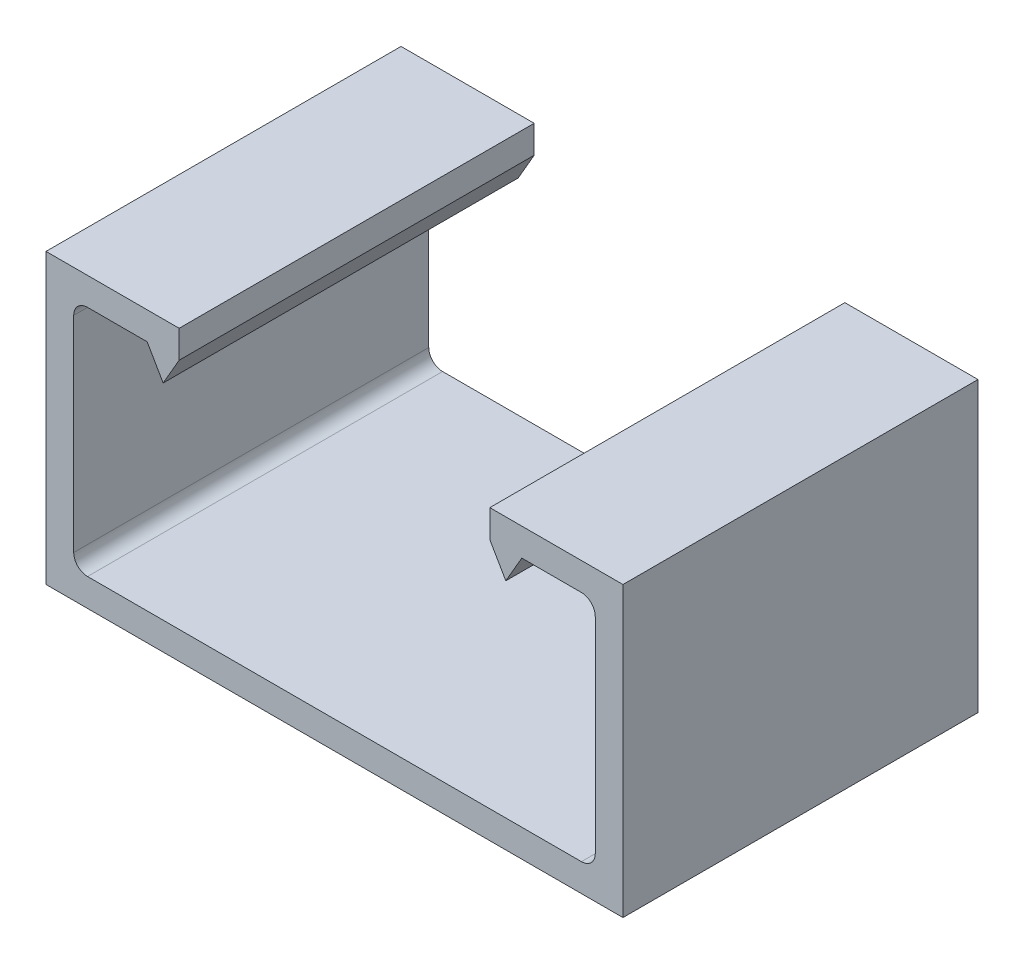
from build123d import *

# Parameters (mm, degrees)
BASE_EXTRUDE_DEPTH = 12.7


with BuildPart() as part:
    # Sketch1 → Base-Extrude (new, symmetric)
    with BuildSketch(Plane.XY):
        with BuildLine():
            Line((-11.1125, 10.31875), (-20.6375, 10.31875))
            Line((-20.6375, 10.31875), (-20.6375, -10.31875))
            Line((-20.6375, -10.31875), (20.6375, -10.31875))
            Line((20.6375, -10.31875), (20.6375, 10.31875))
            Line((20.6375, 10.31875), (11.1125, 10.31875))
            Line((11.1125, 10.31875), (11.1125, 8.33755))
            Line((11.1125, 8.33755), (12.256346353, 6.35635))
            Line((12.256346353, 6.35635), (13.400192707, 8.33755))
            Line((13.400192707, 8.33755), (17.6657, 8.33755))
            ThreePointArc((17.6657, 8.33755), (18.366159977, 8.047409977), (18.6563, 7.34695))
            Line((18.6563, 7.34695), (18.6563, -7.34695))
            ThreePointArc((18.6563, -7.34695), (18.366159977, -8.047409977), (17.6657, -8.33755))
            Line((17.6657, -8.33755), (-17.6657, -8.33755))
            ThreePointArc((-17.6657, -8.33755), (-18.366159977, -8.047409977), (-18.6563, -7.34695))
            Line((-18.6563, -7.34695), (-18.6563, 7.34695))
            ThreePointArc((-18.6563, 7.34695), (-18.366159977, 8.047409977), (-17.6657, 8.33755))
            Line((-17.6657, 8.33755), (-13.400192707, 8.33755))
            Line((-13.400192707, 8.33755), (-12.256346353, 6.35635))
            Line((-12.256346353, 6.35635), (-11.1125, 8.33755))
            Line((-11.1125, 8.33755), (-11.1125, 10.31875))
        make_face()
    extrude(amount=BASE_EXTRUDE_DEPTH, both=True)


solid = part.part
